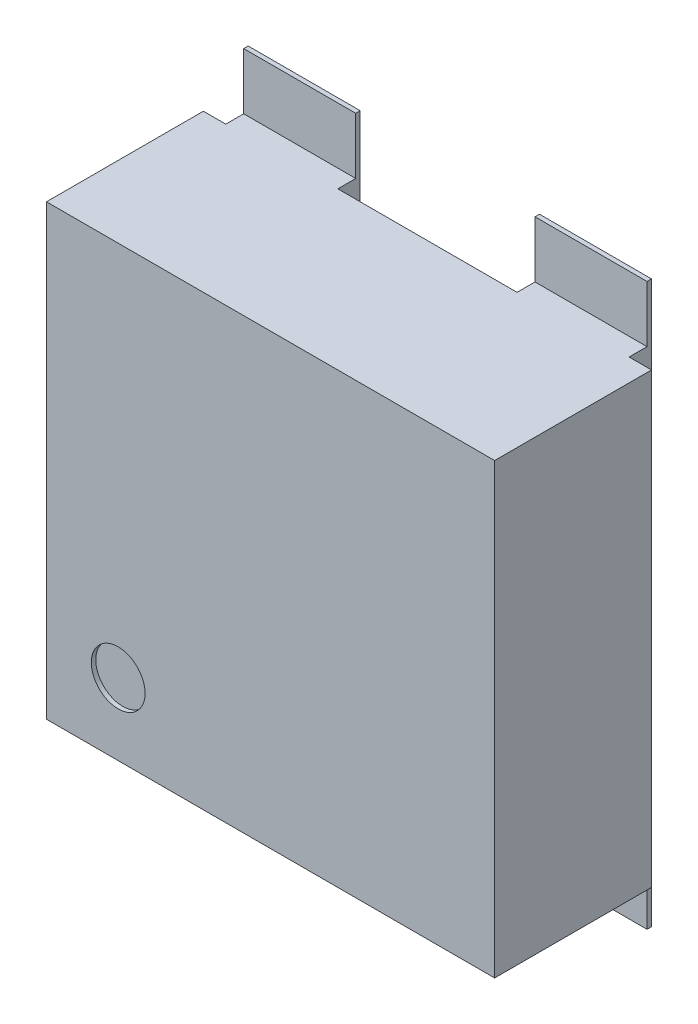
ISO-10303-21;
HEADER;
FILE_DESCRIPTION(('STEP AP214'),'2;1');
FILE_NAME('part.step','',(''),(''),'','','');
FILE_SCHEMA(('AUTOMOTIVE_DESIGN { 1 0 10303 214 1 1 1 1 }'));
ENDSEC;
DATA;
#1=APPLICATION_CONTEXT('core data for automotive mechanical design processes');
#2=APPLICATION_PROTOCOL_DEFINITION('international standard','automotive_design',2000,#1);
#3=PRODUCT_CONTEXT('',#1,'mechanical');
#4=PRODUCT('Part','Part','',(#3));
#5=PRODUCT_RELATED_PRODUCT_CATEGORY('part','',(#4));
#6=PRODUCT_DEFINITION_FORMATION('','',#4);
#7=PRODUCT_DEFINITION_CONTEXT('part definition',#1,'design');
#8=PRODUCT_DEFINITION('design','',#6,#7);
#9=PRODUCT_DEFINITION_SHAPE('','',#8);
#10=(LENGTH_UNIT() NAMED_UNIT(*) SI_UNIT(.MILLI.,.METRE.));
#11=(NAMED_UNIT(*) PLANE_ANGLE_UNIT() SI_UNIT($,.RADIAN.));
#12=(NAMED_UNIT(*) SI_UNIT($,.STERADIAN.) SOLID_ANGLE_UNIT());
#13=UNCERTAINTY_MEASURE_WITH_UNIT(LENGTH_MEASURE(1.E-05),#10,'distance_accuracy_value','');
#14=(GEOMETRIC_REPRESENTATION_CONTEXT(3) GLOBAL_UNCERTAINTY_ASSIGNED_CONTEXT((#13)) GLOBAL_UNIT_ASSIGNED_CONTEXT((#10,
#11,#12)) REPRESENTATION_CONTEXT('',''));
#15=CARTESIAN_POINT('',(0.,0.,0.));
#16=DIRECTION('',(0.,0.,1.));
#17=DIRECTION('',(1.,0.,0.));
#18=AXIS2_PLACEMENT_3D('',#15,#16,#17);
#19=CARTESIAN_POINT('',(-0.063000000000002,-0.276999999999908,0.0762));
#20=DIRECTION('',(0.,-1.,0.));
#21=DIRECTION('',(0.,0.,-1.));
#22=AXIS2_PLACEMENT_3D('',#19,#20,#21);
#23=PLANE('',#22);
#24=DIRECTION('',(0.,0.,1.));
#25=VECTOR('',#24,1.);
#26=CARTESIAN_POINT('',(-0.0630000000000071,-0.276999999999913,0.0762));
#27=LINE('',#26,#25);
#28=CARTESIAN_POINT('',(-0.0630000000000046,-0.276999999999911,0.0762));
#29=VERTEX_POINT('',#28);
#30=CARTESIAN_POINT('',(-0.0630000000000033,-0.276999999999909,0.0862000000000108));
#31=VERTEX_POINT('',#30);
#32=EDGE_CURVE('E292',#29,#31,#27,.T.);
#33=ORIENTED_EDGE('',*,*,#32,.F.);
#34=DIRECTION('',(1.,0.,0.));
#35=VECTOR('',#34,1.);
#36=CARTESIAN_POINT('',(0.,-0.276999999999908,0.0762));
#37=LINE('',#36,#35);
#38=CARTESIAN_POINT('',(0.063000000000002,-0.276999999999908,0.0762));
#39=VERTEX_POINT('',#38);
#40=EDGE_CURVE('E281',#29,#39,#37,.T.);
#41=ORIENTED_EDGE('',*,*,#40,.T.);
#42=DIRECTION('',(0.,0.,1.));
#43=VECTOR('',#42,1.);
#44=CARTESIAN_POINT('',(0.063000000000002,-0.276999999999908,0.0762));
#45=LINE('',#44,#43);
#46=CARTESIAN_POINT('',(0.063000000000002,-0.276999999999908,0.0862000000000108));
#47=VERTEX_POINT('',#46);
#48=EDGE_CURVE('E278',#47,#39,#45,.F.);
#49=ORIENTED_EDGE('',*,*,#48,.F.);
#50=DIRECTION('',(1.,0.,0.));
#51=VECTOR('',#50,1.);
#52=CARTESIAN_POINT('',(0.,-0.276999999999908,0.0862000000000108));
#53=LINE('',#52,#51);
#54=EDGE_CURVE('E275',#31,#47,#53,.T.);
#55=ORIENTED_EDGE('',*,*,#54,.F.);
#56=EDGE_LOOP('',(#33,#41,#49,#55));
#57=FACE_BOUND('',#56,.T.);
#58=ADVANCED_FACE('F16',(#57),#23,.T.);
#59=CARTESIAN_POINT('',(0.063000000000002,-0.276999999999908,0.0762));
#60=DIRECTION('',(0.708384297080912,-0.705826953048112,0.));
#61=DIRECTION('',(0.705826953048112,0.708384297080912,0.));
#62=AXIS2_PLACEMENT_3D('',#59,#60,#61);
#63=PLANE('',#62);
#64=DIRECTION('',(0.705826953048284,0.708384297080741,0.));
#65=VECTOR('',#64,1.);
#66=CARTESIAN_POINT('',(0.063000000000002,-0.276999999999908,0.0762));
#67=LINE('',#66,#65);
#68=CARTESIAN_POINT('',(0.22549362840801,-0.11391762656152,0.0762));
#69=VERTEX_POINT('',#68);
#70=EDGE_CURVE('E306',#39,#69,#67,.T.);
#71=ORIENTED_EDGE('',*,*,#70,.T.);
#72=DIRECTION('',(0.,0.,1.));
#73=VECTOR('',#72,1.);
#74=CARTESIAN_POINT('',(0.225493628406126,-0.113917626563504,0.0762));
#75=LINE('',#74,#73);
#76=CARTESIAN_POINT('',(0.225493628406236,-0.113917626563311,0.0862000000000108));
#77=VERTEX_POINT('',#76);
#78=EDGE_CURVE('E289',#69,#77,#75,.T.);
#79=ORIENTED_EDGE('',*,*,#78,.T.);
#80=DIRECTION('',(0.705826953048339,0.708384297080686,0.));
#81=VECTOR('',#80,1.);
#82=CARTESIAN_POINT('',(0.063000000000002,-0.276999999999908,0.0862000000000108));
#83=LINE('',#82,#81);
#84=EDGE_CURVE('E286',#47,#77,#83,.T.);
#85=ORIENTED_EDGE('',*,*,#84,.F.);
#86=ORIENTED_EDGE('',*,*,#48,.T.);
#87=EDGE_LOOP('',(#71,#79,#85,#86));
#88=FACE_BOUND('',#87,.T.);
#89=ADVANCED_FACE('F287',(#88),#63,.T.);
#90=CARTESIAN_POINT('',(0.,0.,0.0862000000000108));
#91=DIRECTION('',(0.,0.,1.));
#92=DIRECTION('',(1.,0.,0.));
#93=AXIS2_PLACEMENT_3D('',#90,#91,#92);
#94=PLANE('',#93);
#95=ORIENTED_EDGE('',*,*,#84,.T.);
#96=DIRECTION('',(-0.707106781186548,-0.707106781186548,0.));
#97=VECTOR('',#96,1.);
#98=CARTESIAN_POINT('',(0.33941125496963,0.,0.0862000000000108));
#99=LINE('',#98,#97);
#100=CARTESIAN_POINT('',(0.064999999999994,-0.274411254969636,0.0862000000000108));
#101=VERTEX_POINT('',#100);
#102=EDGE_CURVE('E350',#77,#101,#99,.T.);
#103=ORIENTED_EDGE('',*,*,#102,.T.);
#104=DIRECTION('',(1.,0.,0.));
#105=VECTOR('',#104,1.);
#106=CARTESIAN_POINT('',(0.064999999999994,-0.274411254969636,0.0862000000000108));
#107=LINE('',#106,#105);
#108=CARTESIAN_POINT('',(-0.064999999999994,-0.274411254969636,0.0862000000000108));
#109=VERTEX_POINT('',#108);
#110=EDGE_CURVE('E359',#101,#109,#107,.F.);
#111=ORIENTED_EDGE('',*,*,#110,.T.);
#112=DIRECTION('',(-0.707106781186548,0.707106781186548,0.));
#113=VECTOR('',#112,1.);
#114=CARTESIAN_POINT('',(-0.064999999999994,-0.274411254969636,0.0862000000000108));
#115=LINE('',#114,#113);
#116=CARTESIAN_POINT('',(-0.225493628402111,-0.113917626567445,0.0862000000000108));
#117=VERTEX_POINT('',#116);
#118=EDGE_CURVE('E364',#109,#117,#115,.T.);
#119=ORIENTED_EDGE('',*,*,#118,.T.);
#120=DIRECTION('',(0.705826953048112,-0.708384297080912,0.));
#121=VECTOR('',#120,1.);
#122=CARTESIAN_POINT('',(-0.338999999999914,0.,0.0862000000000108));
#123=LINE('',#122,#121);
#124=EDGE_CURVE('E296',#31,#117,#123,.F.);
#125=ORIENTED_EDGE('',*,*,#124,.F.);
#126=ORIENTED_EDGE('',*,*,#54,.T.);
#127=EDGE_LOOP('',(#95,#103,#111,#119,#125,#126));
#128=FACE_BOUND('',#127,.T.);
#129=ADVANCED_FACE('F294',(#128),#94,.T.);
#130=CARTESIAN_POINT('',(-0.338999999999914,0.,0.0762));
#131=DIRECTION('',(-0.708384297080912,-0.705826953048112,0.));
#132=DIRECTION('',(0.705826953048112,-0.708384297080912,0.));
#133=AXIS2_PLACEMENT_3D('',#130,#131,#132);
#134=PLANE('',#133);
#135=ORIENTED_EDGE('',*,*,#124,.T.);
#136=DIRECTION('',(0.,0.,1.));
#137=VECTOR('',#136,1.);
#138=CARTESIAN_POINT('',(-0.225493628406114,-0.113917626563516,0.0762));
#139=LINE('',#138,#137);
#140=CARTESIAN_POINT('',(-0.225493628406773,-0.113917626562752,0.0762));
#141=VERTEX_POINT('',#140);
#142=EDGE_CURVE('E366',#117,#141,#139,.F.);
#143=ORIENTED_EDGE('',*,*,#142,.T.);
#144=DIRECTION('',(0.705826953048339,-0.708384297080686,0.));
#145=VECTOR('',#144,1.);
#146=CARTESIAN_POINT('',(-0.225493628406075,-0.113917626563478,0.0762));
#147=LINE('',#146,#145);
#148=EDGE_CURVE('E302',#141,#29,#147,.T.);
#149=ORIENTED_EDGE('',*,*,#148,.T.);
#150=ORIENTED_EDGE('',*,*,#32,.T.);
#151=EDGE_LOOP('',(#135,#143,#149,#150));
#152=FACE_BOUND('',#151,.T.);
#153=ADVANCED_FACE('F782',(#152),#134,.T.);
#154=CARTESIAN_POINT('',(0.,0.,0.0762));
#155=DIRECTION('',(0.,0.,1.));
#156=DIRECTION('',(1.,0.,0.));
#157=AXIS2_PLACEMENT_3D('',#154,#155,#156);
#158=PLANE('',#157);
#159=DIRECTION('',(0.707106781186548,-0.707106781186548,0.));
#160=VECTOR('',#159,1.);
#161=CARTESIAN_POINT('',(0.,0.33941125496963,0.0762));
#162=LINE('',#161,#160);
#163=CARTESIAN_POINT('',(0.,0.33941125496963,0.0762));
#164=VERTEX_POINT('',#163);
#165=CARTESIAN_POINT('',(0.33941125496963,0.,0.0762));
#166=VERTEX_POINT('',#165);
#167=EDGE_CURVE('E348',#164,#166,#162,.T.);
#168=ORIENTED_EDGE('',*,*,#167,.T.);
#169=DIRECTION('',(-0.707106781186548,-0.707106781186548,0.));
#170=VECTOR('',#169,1.);
#171=CARTESIAN_POINT('',(0.33941125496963,0.,0.0762));
#172=LINE('',#171,#170);
#173=EDGE_CURVE('E355',#166,#69,#172,.T.);
#174=ORIENTED_EDGE('',*,*,#173,.T.);
#175=ORIENTED_EDGE('',*,*,#70,.F.);
#176=ORIENTED_EDGE('',*,*,#40,.F.);
#177=ORIENTED_EDGE('',*,*,#148,.F.);
#178=DIRECTION('',(-0.707106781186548,0.707106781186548,0.));
#179=VECTOR('',#178,1.);
#180=CARTESIAN_POINT('',(-0.064999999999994,-0.274411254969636,0.0762));
#181=LINE('',#180,#179);
#182=CARTESIAN_POINT('',(-0.33941125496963,0.,0.0762));
#183=VERTEX_POINT('',#182);
#184=EDGE_CURVE('E368',#141,#183,#181,.T.);
#185=ORIENTED_EDGE('',*,*,#184,.T.);
#186=DIRECTION('',(0.707106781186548,0.707106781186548,0.));
#187=VECTOR('',#186,1.);
#188=CARTESIAN_POINT('',(-0.33941125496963,0.,0.0762));
#189=LINE('',#188,#187);
#190=EDGE_CURVE('E373',#183,#164,#189,.T.);
#191=ORIENTED_EDGE('',*,*,#190,.T.);
#192=EDGE_LOOP('',(#168,#174,#175,#176,#177,#185,#191));
#193=FACE_BOUND('',#192,.T.);
#194=ADVANCED_FACE('F778',(#193),#158,.F.);
#195=CARTESIAN_POINT('',(0.,0.,0.0762));
#196=DIRECTION('',(0.,0.,1.));
#197=DIRECTION('',(1.,0.,0.));
#198=AXIS2_PLACEMENT_3D('',#195,#196,#197);
#199=PLANE('',#198);
#200=DIRECTION('',(1.,0.,0.));
#201=VECTOR('',#200,1.);
#202=CARTESIAN_POINT('',(0.380000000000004,-0.249999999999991,0.0762));
#203=LINE('',#202,#201);
#204=CARTESIAN_POINT('',(0.38000000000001,-0.249999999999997,0.0762));
#205=VERTEX_POINT('',#204);
#206=CARTESIAN_POINT('',(0.449999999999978,-0.249999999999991,0.0762));
#207=VERTEX_POINT('',#206);
#208=EDGE_CURVE('E329',#205,#207,#203,.T.);
#209=ORIENTED_EDGE('',*,*,#208,.T.);
#210=DIRECTION('',(0.,1.,0.));
#211=VECTOR('',#210,1.);
#212=CARTESIAN_POINT('',(0.449999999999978,-0.249999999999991,0.0762));
#213=LINE('',#212,#211);
#214=CARTESIAN_POINT('',(0.449999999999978,-0.626000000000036,0.0762));
#215=VERTEX_POINT('',#214);
#216=EDGE_CURVE('E400',#207,#215,#213,.F.);
#217=ORIENTED_EDGE('',*,*,#216,.T.);
#218=DIRECTION('',(1.,0.,0.));
#219=VECTOR('',#218,1.);
#220=CARTESIAN_POINT('',(0.199999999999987,-0.626000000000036,0.0762));
#221=LINE('',#220,#219);
#222=CARTESIAN_POINT('',(0.199999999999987,-0.626000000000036,0.0762));
#223=VERTEX_POINT('',#222);
#224=EDGE_CURVE('E308',#223,#215,#221,.T.);
#225=ORIENTED_EDGE('',*,*,#224,.F.);
#226=DIRECTION('',(0.,1.,0.));
#227=VECTOR('',#226,1.);
#228=CARTESIAN_POINT('',(0.199999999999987,-0.500000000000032,0.0762));
#229=LINE('',#228,#227);
#230=CARTESIAN_POINT('',(0.199999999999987,-0.430000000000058,0.0762));
#231=VERTEX_POINT('',#230);
#232=EDGE_CURVE('E390',#223,#231,#229,.T.);
#233=ORIENTED_EDGE('',*,*,#232,.T.);
#234=DIRECTION('',(0.707106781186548,0.707106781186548,0.));
#235=VECTOR('',#234,1.);
#236=CARTESIAN_POINT('',(0.199999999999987,-0.430000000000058,0.0762));
#237=LINE('',#236,#235);
#238=EDGE_CURVE('E327',#231,#205,#237,.T.);
#239=ORIENTED_EDGE('',*,*,#238,.T.);
#240=EDGE_LOOP('',(#209,#217,#225,#233,#239));
#241=FACE_BOUND('',#240,.T.);
#242=ADVANCED_FACE('F774',(#241),#199,.F.);
#243=CARTESIAN_POINT('',(0.199999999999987,-0.626000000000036,0.0762));
#244=DIRECTION('',(0.,-1.,0.));
#245=DIRECTION('',(0.,0.,-1.));
#246=AXIS2_PLACEMENT_3D('',#243,#244,#245);
#247=PLANE('',#246);
#248=DIRECTION('',(0.,0.,-1.));
#249=VECTOR('',#248,1.);
#250=CARTESIAN_POINT('',(0.199999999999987,-0.626000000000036,0.0762));
#251=LINE('',#250,#249);
#252=CARTESIAN_POINT('',(0.199999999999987,-0.626000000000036,0.0862000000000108));
#253=VERTEX_POINT('',#252);
#254=EDGE_CURVE('E387',#253,#223,#251,.T.);
#255=ORIENTED_EDGE('',*,*,#254,.T.);
#256=ORIENTED_EDGE('',*,*,#224,.T.);
#257=DIRECTION('',(0.,0.,1.));
#258=VECTOR('',#257,1.);
#259=CARTESIAN_POINT('',(0.449999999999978,-0.626000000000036,0.0762));
#260=LINE('',#259,#258);
#261=CARTESIAN_POINT('',(0.449999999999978,-0.626000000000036,0.0862000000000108));
#262=VERTEX_POINT('',#261);
#263=EDGE_CURVE('E402',#215,#262,#260,.T.);
#264=ORIENTED_EDGE('',*,*,#263,.T.);
#265=DIRECTION('',(1.,0.,0.));
#266=VECTOR('',#265,1.);
#267=CARTESIAN_POINT('',(0.,-0.626000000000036,0.0862000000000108));
#268=LINE('',#267,#266);
#269=EDGE_CURVE('E397',#253,#262,#268,.T.);
#270=ORIENTED_EDGE('',*,*,#269,.F.);
#271=EDGE_LOOP('',(#255,#256,#264,#270));
#272=FACE_BOUND('',#271,.T.);
#273=ADVANCED_FACE('F770',(#272),#247,.T.);
#274=CARTESIAN_POINT('',(0.,0.,0.0762));
#275=DIRECTION('',(0.,0.,1.));
#276=DIRECTION('',(1.,0.,0.));
#277=AXIS2_PLACEMENT_3D('',#274,#275,#276);
#278=PLANE('',#277);
#279=DIRECTION('',(0.707106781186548,-0.707106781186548,0.));
#280=VECTOR('',#279,1.);
#281=CARTESIAN_POINT('',(-0.380000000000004,-0.249999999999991,0.0762));
#282=LINE('',#281,#280);
#283=CARTESIAN_POINT('',(-0.380000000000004,-0.249999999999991,0.0762));
#284=VERTEX_POINT('',#283);
#285=CARTESIAN_POINT('',(-0.199999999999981,-0.430000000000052,0.0762));
#286=VERTEX_POINT('',#285);
#287=EDGE_CURVE('E322',#284,#286,#282,.T.);
#288=ORIENTED_EDGE('',*,*,#287,.T.);
#289=DIRECTION('',(0.,1.,0.));
#290=VECTOR('',#289,1.);
#291=CARTESIAN_POINT('',(-0.199999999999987,-0.430000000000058,0.0762));
#292=LINE('',#291,#290);
#293=CARTESIAN_POINT('',(-0.199999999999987,-0.626000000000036,0.0762));
#294=VERTEX_POINT('',#293);
#295=EDGE_CURVE('E380',#286,#294,#292,.F.);
#296=ORIENTED_EDGE('',*,*,#295,.T.);
#297=DIRECTION('',(1.,0.,0.));
#298=VECTOR('',#297,1.);
#299=CARTESIAN_POINT('',(-0.449999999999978,-0.626000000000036,0.0762));
#300=LINE('',#299,#298);
#301=CARTESIAN_POINT('',(-0.449999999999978,-0.626000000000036,0.0762));
#302=VERTEX_POINT('',#301);
#303=EDGE_CURVE('E311',#302,#294,#300,.T.);
#304=ORIENTED_EDGE('',*,*,#303,.F.);
#305=DIRECTION('',(0.,1.,0.));
#306=VECTOR('',#305,1.);
#307=CARTESIAN_POINT('',(-0.449999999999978,-0.500000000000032,0.0762));
#308=LINE('',#307,#306);
#309=CARTESIAN_POINT('',(-0.449999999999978,-0.249999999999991,0.0762));
#310=VERTEX_POINT('',#309);
#311=EDGE_CURVE('E412',#302,#310,#308,.T.);
#312=ORIENTED_EDGE('',*,*,#311,.T.);
#313=DIRECTION('',(1.,0.,0.));
#314=VECTOR('',#313,1.);
#315=CARTESIAN_POINT('',(-0.449999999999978,-0.249999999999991,0.0762));
#316=LINE('',#315,#314);
#317=EDGE_CURVE('E320',#310,#284,#316,.T.);
#318=ORIENTED_EDGE('',*,*,#317,.T.);
#319=EDGE_LOOP('',(#288,#296,#304,#312,#318));
#320=FACE_BOUND('',#319,.T.);
#321=ADVANCED_FACE('F766',(#320),#278,.F.);
#322=CARTESIAN_POINT('',(-0.449999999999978,-0.626000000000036,0.0762));
#323=DIRECTION('',(0.,-1.,0.));
#324=DIRECTION('',(0.,0.,-1.));
#325=AXIS2_PLACEMENT_3D('',#322,#323,#324);
#326=PLANE('',#325);
#327=DIRECTION('',(0.,0.,-1.));
#328=VECTOR('',#327,1.);
#329=CARTESIAN_POINT('',(-0.449999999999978,-0.626000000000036,0.0762));
#330=LINE('',#329,#328);
#331=CARTESIAN_POINT('',(-0.449999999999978,-0.626000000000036,0.0862000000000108));
#332=VERTEX_POINT('',#331);
#333=EDGE_CURVE('E409',#332,#302,#330,.T.);
#334=ORIENTED_EDGE('',*,*,#333,.T.);
#335=ORIENTED_EDGE('',*,*,#303,.T.);
#336=DIRECTION('',(0.,0.,1.));
#337=VECTOR('',#336,1.);
#338=CARTESIAN_POINT('',(-0.199999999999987,-0.626000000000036,0.0762));
#339=LINE('',#338,#337);
#340=CARTESIAN_POINT('',(-0.199999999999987,-0.626000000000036,0.0862000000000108));
#341=VERTEX_POINT('',#340);
#342=EDGE_CURVE('E382',#294,#341,#339,.T.);
#343=ORIENTED_EDGE('',*,*,#342,.T.);
#344=DIRECTION('',(1.,0.,0.));
#345=VECTOR('',#344,1.);
#346=CARTESIAN_POINT('',(0.,-0.626000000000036,0.0862000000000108));
#347=LINE('',#346,#345);
#348=EDGE_CURVE('E419',#332,#341,#347,.T.);
#349=ORIENTED_EDGE('',*,*,#348,.F.);
#350=EDGE_LOOP('',(#334,#335,#343,#349));
#351=FACE_BOUND('',#350,.T.);
#352=ADVANCED_FACE('F762',(#351),#326,.T.);
#353=CARTESIAN_POINT('',(0.,0.,0.0762));
#354=DIRECTION('',(0.,0.,1.));
#355=DIRECTION('',(1.,0.,0.));
#356=AXIS2_PLACEMENT_3D('',#353,#354,#355);
#357=PLANE('',#356);
#358=DIRECTION('',(-0.707106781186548,0.707106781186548,0.));
#359=VECTOR('',#358,1.);
#360=CARTESIAN_POINT('',(0.380000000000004,0.249999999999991,0.0762));
#361=LINE('',#360,#359);
#362=CARTESIAN_POINT('',(0.380000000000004,0.249999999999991,0.0762));
#363=VERTEX_POINT('',#362);
#364=CARTESIAN_POINT('',(0.199999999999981,0.430000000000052,0.0762));
#365=VERTEX_POINT('',#364);
#366=EDGE_CURVE('E336',#363,#365,#361,.T.);
#367=ORIENTED_EDGE('',*,*,#366,.T.);
#368=DIRECTION('',(0.,1.,0.));
#369=VECTOR('',#368,1.);
#370=CARTESIAN_POINT('',(0.199999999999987,0.430000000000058,0.0762));
#371=LINE('',#370,#369);
#372=CARTESIAN_POINT('',(0.199999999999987,0.626000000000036,0.0762));
#373=VERTEX_POINT('',#372);
#374=EDGE_CURVE('E445',#365,#373,#371,.T.);
#375=ORIENTED_EDGE('',*,*,#374,.T.);
#376=DIRECTION('',(1.,0.,0.));
#377=VECTOR('',#376,1.);
#378=CARTESIAN_POINT('',(0.449999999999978,0.626000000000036,0.0762));
#379=LINE('',#378,#377);
#380=CARTESIAN_POINT('',(0.449999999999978,0.626000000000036,0.0762));
#381=VERTEX_POINT('',#380);
#382=EDGE_CURVE('E314',#381,#373,#379,.F.);
#383=ORIENTED_EDGE('',*,*,#382,.F.);
#384=DIRECTION('',(0.,1.,0.));
#385=VECTOR('',#384,1.);
#386=CARTESIAN_POINT('',(0.449999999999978,0.500000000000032,0.0762));
#387=LINE('',#386,#385);
#388=CARTESIAN_POINT('',(0.449999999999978,0.249999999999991,0.0762));
#389=VERTEX_POINT('',#388);
#390=EDGE_CURVE('E435',#381,#389,#387,.F.);
#391=ORIENTED_EDGE('',*,*,#390,.T.);
#392=DIRECTION('',(1.,0.,0.));
#393=VECTOR('',#392,1.);
#394=CARTESIAN_POINT('',(0.449999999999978,0.249999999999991,0.0762));
#395=LINE('',#394,#393);
#396=EDGE_CURVE('E334',#389,#363,#395,.F.);
#397=ORIENTED_EDGE('',*,*,#396,.T.);
#398=EDGE_LOOP('',(#367,#375,#383,#391,#397));
#399=FACE_BOUND('',#398,.T.);
#400=ADVANCED_FACE('F758',(#399),#357,.F.);
#401=CARTESIAN_POINT('',(0.449999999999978,0.626000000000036,0.0762));
#402=DIRECTION('',(0.,1.,0.));
#403=DIRECTION('',(0.,0.,1.));
#404=AXIS2_PLACEMENT_3D('',#401,#402,#403);
#405=PLANE('',#404);
#406=DIRECTION('',(0.,0.,1.));
#407=VECTOR('',#406,1.);
#408=CARTESIAN_POINT('',(0.449999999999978,0.626000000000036,0.0762));
#409=LINE('',#408,#407);
#410=CARTESIAN_POINT('',(0.449999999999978,0.626000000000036,0.0862000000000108));
#411=VERTEX_POINT('',#410);
#412=EDGE_CURVE('E432',#411,#381,#409,.F.);
#413=ORIENTED_EDGE('',*,*,#412,.T.);
#414=ORIENTED_EDGE('',*,*,#382,.T.);
#415=DIRECTION('',(0.,0.,-1.));
#416=VECTOR('',#415,1.);
#417=CARTESIAN_POINT('',(0.199999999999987,0.626000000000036,0.0762));
#418=LINE('',#417,#416);
#419=CARTESIAN_POINT('',(0.199999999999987,0.626000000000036,0.0862000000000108));
#420=VERTEX_POINT('',#419);
#421=EDGE_CURVE('E447',#373,#420,#418,.F.);
#422=ORIENTED_EDGE('',*,*,#421,.T.);
#423=DIRECTION('',(1.,0.,0.));
#424=VECTOR('',#423,1.);
#425=CARTESIAN_POINT('',(0.,0.626000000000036,0.0862000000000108));
#426=LINE('',#425,#424);
#427=EDGE_CURVE('E442',#411,#420,#426,.F.);
#428=ORIENTED_EDGE('',*,*,#427,.F.);
#429=EDGE_LOOP('',(#413,#414,#422,#428));
#430=FACE_BOUND('',#429,.T.);
#431=ADVANCED_FACE('F754',(#430),#405,.T.);
#432=CARTESIAN_POINT('',(0.,0.,0.0762));
#433=DIRECTION('',(0.,0.,1.));
#434=DIRECTION('',(1.,0.,0.));
#435=AXIS2_PLACEMENT_3D('',#432,#433,#434);
#436=PLANE('',#435);
#437=DIRECTION('',(1.,0.,0.));
#438=VECTOR('',#437,1.);
#439=CARTESIAN_POINT('',(-0.380000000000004,0.249999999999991,0.0762));
#440=LINE('',#439,#438);
#441=CARTESIAN_POINT('',(-0.38000000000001,0.249999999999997,0.0762));
#442=VERTEX_POINT('',#441);
#443=CARTESIAN_POINT('',(-0.449999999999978,0.249999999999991,0.0762));
#444=VERTEX_POINT('',#443);
#445=EDGE_CURVE('E343',#442,#444,#440,.F.);
#446=ORIENTED_EDGE('',*,*,#445,.T.);
#447=DIRECTION('',(0.,1.,0.));
#448=VECTOR('',#447,1.);
#449=CARTESIAN_POINT('',(-0.449999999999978,0.249999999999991,0.0762));
#450=LINE('',#449,#448);
#451=CARTESIAN_POINT('',(-0.449999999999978,0.626000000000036,0.0762));
#452=VERTEX_POINT('',#451);
#453=EDGE_CURVE('E425',#444,#452,#450,.T.);
#454=ORIENTED_EDGE('',*,*,#453,.T.);
#455=DIRECTION('',(1.,0.,0.));
#456=VECTOR('',#455,1.);
#457=CARTESIAN_POINT('',(-0.199999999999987,0.626000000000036,0.0762));
#458=LINE('',#457,#456);
#459=CARTESIAN_POINT('',(-0.199999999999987,0.626000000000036,0.0762));
#460=VERTEX_POINT('',#459);
#461=EDGE_CURVE('E317',#460,#452,#458,.F.);
#462=ORIENTED_EDGE('',*,*,#461,.F.);
#463=DIRECTION('',(0.,1.,0.));
#464=VECTOR('',#463,1.);
#465=CARTESIAN_POINT('',(-0.199999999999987,0.500000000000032,0.0762));
#466=LINE('',#465,#464);
#467=CARTESIAN_POINT('',(-0.199999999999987,0.430000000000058,0.0762));
#468=VERTEX_POINT('',#467);
#469=EDGE_CURVE('E457',#460,#468,#466,.F.);
#470=ORIENTED_EDGE('',*,*,#469,.T.);
#471=DIRECTION('',(-0.707106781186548,-0.707106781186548,0.));
#472=VECTOR('',#471,1.);
#473=CARTESIAN_POINT('',(-0.199999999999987,0.430000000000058,0.0762));
#474=LINE('',#473,#472);
#475=EDGE_CURVE('E341',#468,#442,#474,.T.);
#476=ORIENTED_EDGE('',*,*,#475,.T.);
#477=EDGE_LOOP('',(#446,#454,#462,#470,#476));
#478=FACE_BOUND('',#477,.T.);
#479=ADVANCED_FACE('F750',(#478),#436,.F.);
#480=CARTESIAN_POINT('',(-0.199999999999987,0.626000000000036,0.0762));
#481=DIRECTION('',(0.,1.,0.));
#482=DIRECTION('',(0.,0.,1.));
#483=AXIS2_PLACEMENT_3D('',#480,#481,#482);
#484=PLANE('',#483);
#485=DIRECTION('',(0.,0.,1.));
#486=VECTOR('',#485,1.);
#487=CARTESIAN_POINT('',(-0.199999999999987,0.626000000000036,0.0762));
#488=LINE('',#487,#486);
#489=CARTESIAN_POINT('',(-0.199999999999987,0.626000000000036,0.0862000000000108));
#490=VERTEX_POINT('',#489);
#491=EDGE_CURVE('E454',#490,#460,#488,.F.);
#492=ORIENTED_EDGE('',*,*,#491,.T.);
#493=ORIENTED_EDGE('',*,*,#461,.T.);
#494=DIRECTION('',(0.,0.,-1.));
#495=VECTOR('',#494,1.);
#496=CARTESIAN_POINT('',(-0.449999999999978,0.626000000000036,0.0762));
#497=LINE('',#496,#495);
#498=CARTESIAN_POINT('',(-0.449999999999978,0.626000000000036,0.0862000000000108));
#499=VERTEX_POINT('',#498);
#500=EDGE_CURVE('E427',#452,#499,#497,.F.);
#501=ORIENTED_EDGE('',*,*,#500,.T.);
#502=DIRECTION('',(1.,0.,0.));
#503=VECTOR('',#502,1.);
#504=CARTESIAN_POINT('',(0.,0.626000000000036,0.0862000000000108));
#505=LINE('',#504,#503);
#506=EDGE_CURVE('E464',#490,#499,#505,.F.);
#507=ORIENTED_EDGE('',*,*,#506,.F.);
#508=EDGE_LOOP('',(#492,#493,#501,#507));
#509=FACE_BOUND('',#508,.T.);
#510=ADVANCED_FACE('F746',(#509),#484,.T.);
#511=CARTESIAN_POINT('',(-0.449999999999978,-0.249999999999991,0.0762));
#512=DIRECTION('',(0.,-1.,0.));
#513=DIRECTION('',(0.,0.,-1.));
#514=AXIS2_PLACEMENT_3D('',#511,#512,#513);
#515=PLANE('',#514);
#516=DIRECTION('',(1.,0.,0.));
#517=VECTOR('',#516,1.);
#518=CARTESIAN_POINT('',(0.,-0.249999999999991,0.126200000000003));
#519=LINE('',#518,#517);
#520=CARTESIAN_POINT('',(-0.449999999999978,-0.249999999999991,0.126200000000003));
#521=VERTEX_POINT('',#520);
#522=CARTESIAN_POINT('',(-0.380000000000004,-0.249999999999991,0.126200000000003));
#523=VERTEX_POINT('',#522);
#524=EDGE_CURVE('E473',#521,#523,#519,.T.);
#525=ORIENTED_EDGE('',*,*,#524,.T.);
#526=DIRECTION('',(0.,0.,1.));
#527=VECTOR('',#526,1.);
#528=CARTESIAN_POINT('',(-0.380000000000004,-0.249999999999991,0.0762));
#529=LINE('',#528,#527);
#530=EDGE_CURVE('E324',#523,#284,#529,.F.);
#531=ORIENTED_EDGE('',*,*,#530,.T.);
#532=ORIENTED_EDGE('',*,*,#317,.F.);
#533=DIRECTION('',(0.,0.,-1.));
#534=VECTOR('',#533,1.);
#535=CARTESIAN_POINT('',(-0.449999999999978,-0.249999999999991,0.0762));
#536=LINE('',#535,#534);
#537=EDGE_CURVE('E414',#310,#521,#536,.F.);
#538=ORIENTED_EDGE('',*,*,#537,.T.);
#539=EDGE_LOOP('',(#525,#531,#532,#538));
#540=FACE_BOUND('',#539,.T.);
#541=ADVANCED_FACE('F742',(#540),#515,.F.);
#542=CARTESIAN_POINT('',(-0.380000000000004,-0.249999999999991,0.0762));
#543=DIRECTION('',(-0.707106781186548,-0.707106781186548,0.));
#544=DIRECTION('',(0.707106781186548,-0.707106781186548,0.));
#545=AXIS2_PLACEMENT_3D('',#542,#543,#544);
#546=PLANE('',#545);
#547=DIRECTION('',(0.707106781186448,-0.707106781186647,0.));
#548=VECTOR('',#547,1.);
#549=CARTESIAN_POINT('',(-0.380000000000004,-0.249999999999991,0.126200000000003));
#550=LINE('',#549,#548);
#551=CARTESIAN_POINT('',(-0.199999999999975,-0.430000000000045,0.126200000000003));
#552=VERTEX_POINT('',#551);
#553=EDGE_CURVE('E475',#523,#552,#550,.T.);
#554=ORIENTED_EDGE('',*,*,#553,.T.);
#555=DIRECTION('',(0.,0.,1.));
#556=VECTOR('',#555,1.);
#557=CARTESIAN_POINT('',(-0.199999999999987,-0.430000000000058,0.0762));
#558=LINE('',#557,#556);
#559=EDGE_CURVE('E384',#552,#286,#558,.F.);
#560=ORIENTED_EDGE('',*,*,#559,.T.);
#561=ORIENTED_EDGE('',*,*,#287,.F.);
#562=ORIENTED_EDGE('',*,*,#530,.F.);
#563=EDGE_LOOP('',(#554,#560,#561,#562));
#564=FACE_BOUND('',#563,.T.);
#565=ADVANCED_FACE('F738',(#564),#546,.F.);
#566=CARTESIAN_POINT('',(0.199999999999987,-0.430000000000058,0.0762));
#567=DIRECTION('',(0.707106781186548,-0.707106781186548,0.));
#568=DIRECTION('',(0.707106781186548,0.707106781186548,0.));
#569=AXIS2_PLACEMENT_3D('',#566,#567,#568);
#570=PLANE('',#569);
#571=DIRECTION('',(0.707106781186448,0.707106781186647,0.));
#572=VECTOR('',#571,1.);
#573=CARTESIAN_POINT('',(0.199999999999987,-0.430000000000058,0.126200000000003));
#574=LINE('',#573,#572);
#575=CARTESIAN_POINT('',(0.199999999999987,-0.430000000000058,0.126200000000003));
#576=VERTEX_POINT('',#575);
#577=CARTESIAN_POINT('',(0.380000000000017,-0.250000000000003,0.126200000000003));
#578=VERTEX_POINT('',#577);
#579=EDGE_CURVE('E482',#576,#578,#574,.T.);
#580=ORIENTED_EDGE('',*,*,#579,.T.);
#581=DIRECTION('',(0.,0.,-1.));
#582=VECTOR('',#581,1.);
#583=CARTESIAN_POINT('',(0.380000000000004,-0.249999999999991,0.0762));
#584=LINE('',#583,#582);
#585=EDGE_CURVE('E331',#578,#205,#584,.T.);
#586=ORIENTED_EDGE('',*,*,#585,.T.);
#587=ORIENTED_EDGE('',*,*,#238,.F.);
#588=DIRECTION('',(0.,0.,-1.));
#589=VECTOR('',#588,1.);
#590=CARTESIAN_POINT('',(0.199999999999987,-0.430000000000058,0.0762));
#591=LINE('',#590,#589);
#592=EDGE_CURVE('E392',#231,#576,#591,.F.);
#593=ORIENTED_EDGE('',*,*,#592,.T.);
#594=EDGE_LOOP('',(#580,#586,#587,#593));
#595=FACE_BOUND('',#594,.T.);
#596=ADVANCED_FACE('F734',(#595),#570,.F.);
#597=CARTESIAN_POINT('',(0.380000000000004,-0.249999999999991,0.0762));
#598=DIRECTION('',(0.,-1.,0.));
#599=DIRECTION('',(0.,0.,-1.));
#600=AXIS2_PLACEMENT_3D('',#597,#598,#599);
#601=PLANE('',#600);
#602=DIRECTION('',(1.,0.,0.));
#603=VECTOR('',#602,1.);
#604=CARTESIAN_POINT('',(0.,-0.249999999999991,0.126200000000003));
#605=LINE('',#604,#603);
#606=CARTESIAN_POINT('',(0.449999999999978,-0.249999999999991,0.126200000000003));
#607=VERTEX_POINT('',#606);
#608=EDGE_CURVE('E484',#578,#607,#605,.T.);
#609=ORIENTED_EDGE('',*,*,#608,.T.);
#610=DIRECTION('',(0.,0.,1.));
#611=VECTOR('',#610,1.);
#612=CARTESIAN_POINT('',(0.449999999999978,-0.249999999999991,0.0762));
#613=LINE('',#612,#611);
#614=EDGE_CURVE('E406',#607,#207,#613,.F.);
#615=ORIENTED_EDGE('',*,*,#614,.T.);
#616=ORIENTED_EDGE('',*,*,#208,.F.);
#617=ORIENTED_EDGE('',*,*,#585,.F.);
#618=EDGE_LOOP('',(#609,#615,#616,#617));
#619=FACE_BOUND('',#618,.T.);
#620=ADVANCED_FACE('F730',(#619),#601,.F.);
#621=CARTESIAN_POINT('',(0.449999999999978,0.249999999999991,0.0762));
#622=DIRECTION('',(0.,1.,0.));
#623=DIRECTION('',(0.,0.,1.));
#624=AXIS2_PLACEMENT_3D('',#621,#622,#623);
#625=PLANE('',#624);
#626=DIRECTION('',(1.,0.,0.));
#627=VECTOR('',#626,1.);
#628=CARTESIAN_POINT('',(0.,0.249999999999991,0.126200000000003));
#629=LINE('',#628,#627);
#630=CARTESIAN_POINT('',(0.449999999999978,0.249999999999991,0.126200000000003));
#631=VERTEX_POINT('',#630);
#632=CARTESIAN_POINT('',(0.380000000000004,0.249999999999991,0.126200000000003));
#633=VERTEX_POINT('',#632);
#634=EDGE_CURVE('E491',#631,#633,#629,.F.);
#635=ORIENTED_EDGE('',*,*,#634,.T.);
#636=DIRECTION('',(0.,0.,1.));
#637=VECTOR('',#636,1.);
#638=CARTESIAN_POINT('',(0.380000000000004,0.249999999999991,0.0762));
#639=LINE('',#638,#637);
#640=EDGE_CURVE('E338',#633,#363,#639,.F.);
#641=ORIENTED_EDGE('',*,*,#640,.T.);
#642=ORIENTED_EDGE('',*,*,#396,.F.);
#643=DIRECTION('',(0.,0.,1.));
#644=VECTOR('',#643,1.);
#645=CARTESIAN_POINT('',(0.449999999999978,0.249999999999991,0.0762));
#646=LINE('',#645,#644);
#647=EDGE_CURVE('E437',#389,#631,#646,.T.);
#648=ORIENTED_EDGE('',*,*,#647,.T.);
#649=EDGE_LOOP('',(#635,#641,#642,#648));
#650=FACE_BOUND('',#649,.T.);
#651=ADVANCED_FACE('F726',(#650),#625,.F.);
#652=CARTESIAN_POINT('',(0.380000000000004,0.249999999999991,0.0762));
#653=DIRECTION('',(0.707106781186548,0.707106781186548,0.));
#654=DIRECTION('',(-0.707106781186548,0.707106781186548,0.));
#655=AXIS2_PLACEMENT_3D('',#652,#653,#654);
#656=PLANE('',#655);
#657=DIRECTION('',(-0.707106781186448,0.707106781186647,0.));
#658=VECTOR('',#657,1.);
#659=CARTESIAN_POINT('',(0.380000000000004,0.249999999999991,0.126200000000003));
#660=LINE('',#659,#658);
#661=CARTESIAN_POINT('',(0.199999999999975,0.430000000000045,0.126200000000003));
#662=VERTEX_POINT('',#661);
#663=EDGE_CURVE('E493',#633,#662,#660,.T.);
#664=ORIENTED_EDGE('',*,*,#663,.T.);
#665=DIRECTION('',(0.,0.,-1.));
#666=VECTOR('',#665,1.);
#667=CARTESIAN_POINT('',(0.199999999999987,0.430000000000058,0.0762));
#668=LINE('',#667,#666);
#669=EDGE_CURVE('E451',#662,#365,#668,.T.);
#670=ORIENTED_EDGE('',*,*,#669,.T.);
#671=ORIENTED_EDGE('',*,*,#366,.F.);
#672=ORIENTED_EDGE('',*,*,#640,.F.);
#673=EDGE_LOOP('',(#664,#670,#671,#672));
#674=FACE_BOUND('',#673,.T.);
#675=ADVANCED_FACE('F722',(#674),#656,.F.);
#676=CARTESIAN_POINT('',(-0.199999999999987,0.430000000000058,0.0762));
#677=DIRECTION('',(-0.707106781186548,0.707106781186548,0.));
#678=DIRECTION('',(-0.707106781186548,-0.707106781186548,0.));
#679=AXIS2_PLACEMENT_3D('',#676,#677,#678);
#680=PLANE('',#679);
#681=DIRECTION('',(-0.707106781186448,-0.707106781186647,0.));
#682=VECTOR('',#681,1.);
#683=CARTESIAN_POINT('',(-0.199999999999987,0.430000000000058,0.126200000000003));
#684=LINE('',#683,#682);
#685=CARTESIAN_POINT('',(-0.199999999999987,0.430000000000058,0.126200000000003));
#686=VERTEX_POINT('',#685);
#687=CARTESIAN_POINT('',(-0.380000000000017,0.250000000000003,0.126200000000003));
#688=VERTEX_POINT('',#687);
#689=EDGE_CURVE('E500',#686,#688,#684,.T.);
#690=ORIENTED_EDGE('',*,*,#689,.T.);
#691=DIRECTION('',(0.,0.,1.));
#692=VECTOR('',#691,1.);
#693=CARTESIAN_POINT('',(-0.380000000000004,0.249999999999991,0.0762));
#694=LINE('',#693,#692);
#695=EDGE_CURVE('E345',#688,#442,#694,.F.);
#696=ORIENTED_EDGE('',*,*,#695,.T.);
#697=ORIENTED_EDGE('',*,*,#475,.F.);
#698=DIRECTION('',(0.,0.,1.));
#699=VECTOR('',#698,1.);
#700=CARTESIAN_POINT('',(-0.199999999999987,0.430000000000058,0.0762));
#701=LINE('',#700,#699);
#702=EDGE_CURVE('E459',#468,#686,#701,.T.);
#703=ORIENTED_EDGE('',*,*,#702,.T.);
#704=EDGE_LOOP('',(#690,#696,#697,#703));
#705=FACE_BOUND('',#704,.T.);
#706=ADVANCED_FACE('F718',(#705),#680,.F.);
#707=CARTESIAN_POINT('',(-0.380000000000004,0.249999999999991,0.0762));
#708=DIRECTION('',(0.,1.,0.));
#709=DIRECTION('',(0.,0.,1.));
#710=AXIS2_PLACEMENT_3D('',#707,#708,#709);
#711=PLANE('',#710);
#712=DIRECTION('',(1.,0.,0.));
#713=VECTOR('',#712,1.);
#714=CARTESIAN_POINT('',(0.,0.249999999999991,0.126200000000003));
#715=LINE('',#714,#713);
#716=CARTESIAN_POINT('',(-0.449999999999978,0.249999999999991,0.126200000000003));
#717=VERTEX_POINT('',#716);
#718=EDGE_CURVE('E502',#688,#717,#715,.F.);
#719=ORIENTED_EDGE('',*,*,#718,.T.);
#720=DIRECTION('',(0.,0.,-1.));
#721=VECTOR('',#720,1.);
#722=CARTESIAN_POINT('',(-0.449999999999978,0.249999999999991,0.0762));
#723=LINE('',#722,#721);
#724=EDGE_CURVE('E429',#717,#444,#723,.T.);
#725=ORIENTED_EDGE('',*,*,#724,.T.);
#726=ORIENTED_EDGE('',*,*,#445,.F.);
#727=ORIENTED_EDGE('',*,*,#695,.F.);
#728=EDGE_LOOP('',(#719,#725,#726,#727));
#729=FACE_BOUND('',#728,.T.);
#730=ADVANCED_FACE('F714',(#729),#711,.F.);
#731=CARTESIAN_POINT('',(0.,0.33941125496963,0.0762));
#732=DIRECTION('',(-0.707106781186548,-0.707106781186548,0.));
#733=DIRECTION('',(0.707106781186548,-0.707106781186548,0.));
#734=AXIS2_PLACEMENT_3D('',#731,#732,#733);
#735=PLANE('',#734);
#736=DIRECTION('',(0.707106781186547,-0.707106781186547,0.));
#737=VECTOR('',#736,1.);
#738=CARTESIAN_POINT('',(0.,0.33941125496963,0.126200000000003));
#739=LINE('',#738,#737);
#740=CARTESIAN_POINT('',(0.,0.33941125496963,0.126200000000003));
#741=VERTEX_POINT('',#740);
#742=CARTESIAN_POINT('',(0.33941125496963,0.,0.126200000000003));
#743=VERTEX_POINT('',#742);
#744=EDGE_CURVE('E506',#741,#743,#739,.T.);
#745=ORIENTED_EDGE('',*,*,#744,.T.);
#746=DIRECTION('',(0.,0.,1.));
#747=VECTOR('',#746,1.);
#748=CARTESIAN_POINT('',(0.33941125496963,0.,0.0762));
#749=LINE('',#748,#747);
#750=EDGE_CURVE('E352',#743,#166,#749,.F.);
#751=ORIENTED_EDGE('',*,*,#750,.T.);
#752=ORIENTED_EDGE('',*,*,#167,.F.);
#753=DIRECTION('',(0.,0.,1.));
#754=VECTOR('',#753,1.);
#755=CARTESIAN_POINT('',(0.,0.33941125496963,0.0762));
#756=LINE('',#755,#754);
#757=EDGE_CURVE('E375',#164,#741,#756,.T.);
#758=ORIENTED_EDGE('',*,*,#757,.T.);
#759=EDGE_LOOP('',(#745,#751,#752,#758));
#760=FACE_BOUND('',#759,.T.);
#761=ADVANCED_FACE('F710',(#760),#735,.F.);
#762=CARTESIAN_POINT('',(0.33941125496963,0.,0.0762));
#763=DIRECTION('',(-0.707106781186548,0.707106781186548,0.));
#764=DIRECTION('',(-0.707106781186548,-0.707106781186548,0.));
#765=AXIS2_PLACEMENT_3D('',#762,#763,#764);
#766=PLANE('',#765);
#767=ORIENTED_EDGE('',*,*,#173,.F.);
#768=ORIENTED_EDGE('',*,*,#750,.F.);
#769=DIRECTION('',(-0.707106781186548,-0.707106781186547,0.));
#770=VECTOR('',#769,1.);
#771=CARTESIAN_POINT('',(0.33941125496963,0.,0.126200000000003));
#772=LINE('',#771,#770);
#773=CARTESIAN_POINT('',(0.064999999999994,-0.274411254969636,0.126200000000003));
#774=VERTEX_POINT('',#773);
#775=EDGE_CURVE('E508',#743,#774,#772,.T.);
#776=ORIENTED_EDGE('',*,*,#775,.T.);
#777=DIRECTION('',(0.,0.,1.));
#778=VECTOR('',#777,1.);
#779=CARTESIAN_POINT('',(0.064999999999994,-0.274411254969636,0.0762));
#780=LINE('',#779,#778);
#781=EDGE_CURVE('E361',#774,#101,#780,.F.);
#782=ORIENTED_EDGE('',*,*,#781,.T.);
#783=ORIENTED_EDGE('',*,*,#102,.F.);
#784=ORIENTED_EDGE('',*,*,#78,.F.);
#785=EDGE_LOOP('',(#767,#768,#776,#782,#783,#784));
#786=FACE_BOUND('',#785,.T.);
#787=ADVANCED_FACE('F706',(#786),#766,.F.);
#788=CARTESIAN_POINT('',(0.064999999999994,-0.274411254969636,0.0762));
#789=DIRECTION('',(0.,1.,0.));
#790=DIRECTION('',(0.,0.,1.));
#791=AXIS2_PLACEMENT_3D('',#788,#789,#790);
#792=PLANE('',#791);
#793=DIRECTION('',(1.,0.,0.));
#794=VECTOR('',#793,1.);
#795=CARTESIAN_POINT('',(0.,-0.274411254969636,0.126200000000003));
#796=LINE('',#795,#794);
#797=CARTESIAN_POINT('',(-0.064999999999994,-0.274411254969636,0.126200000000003));
#798=VERTEX_POINT('',#797);
#799=EDGE_CURVE('E510',#774,#798,#796,.F.);
#800=ORIENTED_EDGE('',*,*,#799,.T.);
#801=DIRECTION('',(0.,0.,1.));
#802=VECTOR('',#801,1.);
#803=CARTESIAN_POINT('',(-0.064999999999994,-0.274411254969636,0.0762));
#804=LINE('',#803,#802);
#805=EDGE_CURVE('E370',#798,#109,#804,.F.);
#806=ORIENTED_EDGE('',*,*,#805,.T.);
#807=ORIENTED_EDGE('',*,*,#110,.F.);
#808=ORIENTED_EDGE('',*,*,#781,.F.);
#809=EDGE_LOOP('',(#800,#806,#807,#808));
#810=FACE_BOUND('',#809,.T.);
#811=ADVANCED_FACE('F702',(#810),#792,.F.);
#812=CARTESIAN_POINT('',(-0.064999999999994,-0.274411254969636,0.0762));
#813=DIRECTION('',(0.707106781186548,0.707106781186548,0.));
#814=DIRECTION('',(-0.707106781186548,0.707106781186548,0.));
#815=AXIS2_PLACEMENT_3D('',#812,#813,#814);
#816=PLANE('',#815);
#817=DIRECTION('',(-0.707106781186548,0.707106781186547,0.));
#818=VECTOR('',#817,1.);
#819=CARTESIAN_POINT('',(-0.064999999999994,-0.274411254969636,0.126200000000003));
#820=LINE('',#819,#818);
#821=CARTESIAN_POINT('',(-0.33941125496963,0.,0.126200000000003));
#822=VERTEX_POINT('',#821);
#823=EDGE_CURVE('E512',#798,#822,#820,.T.);
#824=ORIENTED_EDGE('',*,*,#823,.T.);
#825=DIRECTION('',(0.,0.,1.));
#826=VECTOR('',#825,1.);
#827=CARTESIAN_POINT('',(-0.33941125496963,0.,0.0762));
#828=LINE('',#827,#826);
#829=EDGE_CURVE('E377',#822,#183,#828,.F.);
#830=ORIENTED_EDGE('',*,*,#829,.T.);
#831=ORIENTED_EDGE('',*,*,#184,.F.);
#832=ORIENTED_EDGE('',*,*,#142,.F.);
#833=ORIENTED_EDGE('',*,*,#118,.F.);
#834=ORIENTED_EDGE('',*,*,#805,.F.);
#835=EDGE_LOOP('',(#824,#830,#831,#832,#833,#834));
#836=FACE_BOUND('',#835,.T.);
#837=ADVANCED_FACE('F698',(#836),#816,.F.);
#838=CARTESIAN_POINT('',(-0.33941125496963,0.,0.0762));
#839=DIRECTION('',(0.707106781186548,-0.707106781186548,0.));
#840=DIRECTION('',(0.707106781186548,0.707106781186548,0.));
#841=AXIS2_PLACEMENT_3D('',#838,#839,#840);
#842=PLANE('',#841);
#843=DIRECTION('',(0.707106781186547,0.707106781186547,0.));
#844=VECTOR('',#843,1.);
#845=CARTESIAN_POINT('',(-0.33941125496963,0.,0.126200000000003));
#846=LINE('',#845,#844);
#847=EDGE_CURVE('E514',#822,#741,#846,.T.);
#848=ORIENTED_EDGE('',*,*,#847,.T.);
#849=ORIENTED_EDGE('',*,*,#757,.F.);
#850=ORIENTED_EDGE('',*,*,#190,.F.);
#851=ORIENTED_EDGE('',*,*,#829,.F.);
#852=EDGE_LOOP('',(#848,#849,#850,#851));
#853=FACE_BOUND('',#852,.T.);
#854=ADVANCED_FACE('F694',(#853),#842,.F.);
#855=CARTESIAN_POINT('',(-0.199999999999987,-0.430000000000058,0.0762));
#856=DIRECTION('',(-1.,0.,0.));
#857=DIRECTION('',(0.,0.,1.));
#858=AXIS2_PLACEMENT_3D('',#855,#856,#857);
#859=PLANE('',#858);
#860=DIRECTION('',(0.,1.,0.));
#861=VECTOR('',#860,1.);
#862=CARTESIAN_POINT('',(-0.199999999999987,0.,0.126200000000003));
#863=LINE('',#862,#861);
#864=CARTESIAN_POINT('',(-0.199999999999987,-0.500000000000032,0.126200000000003));
#865=VERTEX_POINT('',#864);
#866=EDGE_CURVE('E477',#552,#865,#863,.F.);
#867=ORIENTED_EDGE('',*,*,#866,.T.);
#868=DIRECTION('',(0.,0.,-1.));
#869=VECTOR('',#868,1.);
#870=CARTESIAN_POINT('',(-0.199999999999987,-0.500000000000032,0.0762));
#871=LINE('',#870,#869);
#872=CARTESIAN_POINT('',(-0.199999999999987,-0.500000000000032,0.0862000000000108));
#873=VERTEX_POINT('',#872);
#874=EDGE_CURVE('E517',#873,#865,#871,.F.);
#875=ORIENTED_EDGE('',*,*,#874,.F.);
#876=DIRECTION('',(0.,1.,0.));
#877=VECTOR('',#876,1.);
#878=CARTESIAN_POINT('',(-0.199999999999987,0.,0.0862000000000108));
#879=LINE('',#878,#877);
#880=EDGE_CURVE('E422',#341,#873,#879,.T.);
#881=ORIENTED_EDGE('',*,*,#880,.F.);
#882=ORIENTED_EDGE('',*,*,#342,.F.);
#883=ORIENTED_EDGE('',*,*,#295,.F.);
#884=ORIENTED_EDGE('',*,*,#559,.F.);
#885=EDGE_LOOP('',(#867,#875,#881,#882,#883,#884));
#886=FACE_BOUND('',#885,.T.);
#887=ADVANCED_FACE('F690',(#886),#859,.F.);
#888=CARTESIAN_POINT('',(0.199999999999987,-0.500000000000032,0.0762));
#889=DIRECTION('',(1.,0.,0.));
#890=DIRECTION('',(0.,0.,-1.));
#891=AXIS2_PLACEMENT_3D('',#888,#889,#890);
#892=PLANE('',#891);
#893=ORIENTED_EDGE('',*,*,#592,.F.);
#894=ORIENTED_EDGE('',*,*,#232,.F.);
#895=ORIENTED_EDGE('',*,*,#254,.F.);
#896=DIRECTION('',(0.,1.,0.));
#897=VECTOR('',#896,1.);
#898=CARTESIAN_POINT('',(0.199999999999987,0.,0.0862000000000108));
#899=LINE('',#898,#897);
#900=CARTESIAN_POINT('',(0.199999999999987,-0.500000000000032,0.0862000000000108));
#901=VERTEX_POINT('',#900);
#902=EDGE_CURVE('E394',#901,#253,#899,.F.);
#903=ORIENTED_EDGE('',*,*,#902,.F.);
#904=DIRECTION('',(0.,0.,-1.));
#905=VECTOR('',#904,1.);
#906=CARTESIAN_POINT('',(0.199999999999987,-0.500000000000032,0.0762));
#907=LINE('',#906,#905);
#908=CARTESIAN_POINT('',(0.199999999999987,-0.500000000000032,0.126200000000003));
#909=VERTEX_POINT('',#908);
#910=EDGE_CURVE('E523',#909,#901,#907,.T.);
#911=ORIENTED_EDGE('',*,*,#910,.F.);
#912=DIRECTION('',(0.,1.,0.));
#913=VECTOR('',#912,1.);
#914=CARTESIAN_POINT('',(0.199999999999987,0.,0.126200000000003));
#915=LINE('',#914,#913);
#916=EDGE_CURVE('E479',#909,#576,#915,.T.);
#917=ORIENTED_EDGE('',*,*,#916,.T.);
#918=EDGE_LOOP('',(#893,#894,#895,#903,#911,#917));
#919=FACE_BOUND('',#918,.T.);
#920=ADVANCED_FACE('F686',(#919),#892,.F.);
#921=CARTESIAN_POINT('',(0.,0.,0.0862000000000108));
#922=DIRECTION('',(0.,0.,1.));
#923=DIRECTION('',(1.,0.,0.));
#924=AXIS2_PLACEMENT_3D('',#921,#922,#923);
#925=PLANE('',#924);
#926=DIRECTION('',(0.,1.,0.));
#927=VECTOR('',#926,1.);
#928=CARTESIAN_POINT('',(0.449999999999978,-0.249999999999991,0.0862000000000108));
#929=LINE('',#928,#927);
#930=CARTESIAN_POINT('',(0.449999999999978,-0.500000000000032,0.0862000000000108));
#931=VERTEX_POINT('',#930);
#932=EDGE_CURVE('E404',#262,#931,#929,.T.);
#933=ORIENTED_EDGE('',*,*,#932,.T.);
#934=DIRECTION('',(1.,0.,0.));
#935=VECTOR('',#934,1.);
#936=CARTESIAN_POINT('',(-0.500000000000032,-0.500000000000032,0.0862000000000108));
#937=LINE('',#936,#935);
#938=EDGE_CURVE('E526',#901,#931,#937,.T.);
#939=ORIENTED_EDGE('',*,*,#938,.F.);
#940=ORIENTED_EDGE('',*,*,#902,.T.);
#941=ORIENTED_EDGE('',*,*,#269,.T.);
#942=EDGE_LOOP('',(#933,#939,#940,#941));
#943=FACE_BOUND('',#942,.T.);
#944=ADVANCED_FACE('F682',(#943),#925,.T.);
#945=CARTESIAN_POINT('',(0.449999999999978,-0.249999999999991,0.0762));
#946=DIRECTION('',(-1.,0.,0.));
#947=DIRECTION('',(0.,0.,1.));
#948=AXIS2_PLACEMENT_3D('',#945,#946,#947);
#949=PLANE('',#948);
#950=DIRECTION('',(0.,1.,0.));
#951=VECTOR('',#950,1.);
#952=CARTESIAN_POINT('',(0.449999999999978,0.,0.126200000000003));
#953=LINE('',#952,#951);
#954=CARTESIAN_POINT('',(0.449999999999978,-0.500000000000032,0.126200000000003));
#955=VERTEX_POINT('',#954);
#956=EDGE_CURVE('E486',#607,#955,#953,.F.);
#957=ORIENTED_EDGE('',*,*,#956,.T.);
#958=DIRECTION('',(0.,0.,-1.));
#959=VECTOR('',#958,1.);
#960=CARTESIAN_POINT('',(0.449999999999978,-0.500000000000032,0.0762));
#961=LINE('',#960,#959);
#962=EDGE_CURVE('E529',#931,#955,#961,.F.);
#963=ORIENTED_EDGE('',*,*,#962,.F.);
#964=ORIENTED_EDGE('',*,*,#932,.F.);
#965=ORIENTED_EDGE('',*,*,#263,.F.);
#966=ORIENTED_EDGE('',*,*,#216,.F.);
#967=ORIENTED_EDGE('',*,*,#614,.F.);
#968=EDGE_LOOP('',(#957,#963,#964,#965,#966,#967));
#969=FACE_BOUND('',#968,.T.);
#970=ADVANCED_FACE('F678',(#969),#949,.F.);
#971=CARTESIAN_POINT('',(-0.449999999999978,-0.500000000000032,0.0762));
#972=DIRECTION('',(1.,0.,0.));
#973=DIRECTION('',(0.,0.,-1.));
#974=AXIS2_PLACEMENT_3D('',#971,#972,#973);
#975=PLANE('',#974);
#976=ORIENTED_EDGE('',*,*,#537,.F.);
#977=ORIENTED_EDGE('',*,*,#311,.F.);
#978=ORIENTED_EDGE('',*,*,#333,.F.);
#979=DIRECTION('',(0.,1.,0.));
#980=VECTOR('',#979,1.);
#981=CARTESIAN_POINT('',(-0.449999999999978,0.,0.0862000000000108));
#982=LINE('',#981,#980);
#983=CARTESIAN_POINT('',(-0.449999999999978,-0.500000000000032,0.0862000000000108));
#984=VERTEX_POINT('',#983);
#985=EDGE_CURVE('E416',#984,#332,#982,.F.);
#986=ORIENTED_EDGE('',*,*,#985,.F.);
#987=DIRECTION('',(0.,0.,-1.));
#988=VECTOR('',#987,1.);
#989=CARTESIAN_POINT('',(-0.449999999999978,-0.500000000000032,0.0762));
#990=LINE('',#989,#988);
#991=CARTESIAN_POINT('',(-0.449999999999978,-0.500000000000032,0.126200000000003));
#992=VERTEX_POINT('',#991);
#993=EDGE_CURVE('E537',#992,#984,#990,.T.);
#994=ORIENTED_EDGE('',*,*,#993,.F.);
#995=DIRECTION('',(0.,1.,0.));
#996=VECTOR('',#995,1.);
#997=CARTESIAN_POINT('',(-0.449999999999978,0.,0.126200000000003));
#998=LINE('',#997,#996);
#999=EDGE_CURVE('E470',#992,#521,#998,.T.);
#1000=ORIENTED_EDGE('',*,*,#999,.T.);
#1001=EDGE_LOOP('',(#976,#977,#978,#986,#994,#1000));
#1002=FACE_BOUND('',#1001,.T.);
#1003=ADVANCED_FACE('F674',(#1002),#975,.F.);
#1004=CARTESIAN_POINT('',(0.,0.,0.0862000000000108));
#1005=DIRECTION('',(0.,0.,1.));
#1006=DIRECTION('',(1.,0.,0.));
#1007=AXIS2_PLACEMENT_3D('',#1004,#1005,#1006);
#1008=PLANE('',#1007);
#1009=ORIENTED_EDGE('',*,*,#880,.T.);
#1010=DIRECTION('',(1.,0.,0.));
#1011=VECTOR('',#1010,1.);
#1012=CARTESIAN_POINT('',(-0.500000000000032,-0.500000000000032,0.0862000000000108));
#1013=LINE('',#1012,#1011);
#1014=EDGE_CURVE('E540',#984,#873,#1013,.T.);
#1015=ORIENTED_EDGE('',*,*,#1014,.F.);
#1016=ORIENTED_EDGE('',*,*,#985,.T.);
#1017=ORIENTED_EDGE('',*,*,#348,.T.);
#1018=EDGE_LOOP('',(#1009,#1015,#1016,#1017));
#1019=FACE_BOUND('',#1018,.T.);
#1020=ADVANCED_FACE('F670',(#1019),#1008,.T.);
#1021=CARTESIAN_POINT('',(-0.449999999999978,0.249999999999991,0.0762));
#1022=DIRECTION('',(1.,0.,0.));
#1023=DIRECTION('',(0.,0.,-1.));
#1024=AXIS2_PLACEMENT_3D('',#1021,#1022,#1023);
#1025=PLANE('',#1024);
#1026=DIRECTION('',(0.,1.,0.));
#1027=VECTOR('',#1026,1.);
#1028=CARTESIAN_POINT('',(-0.449999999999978,0.,0.126200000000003));
#1029=LINE('',#1028,#1027);
#1030=CARTESIAN_POINT('',(-0.449999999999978,0.500000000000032,0.126200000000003));
#1031=VERTEX_POINT('',#1030);
#1032=EDGE_CURVE('E504',#717,#1031,#1029,.T.);
#1033=ORIENTED_EDGE('',*,*,#1032,.T.);
#1034=DIRECTION('',(0.,0.,1.));
#1035=VECTOR('',#1034,1.);
#1036=CARTESIAN_POINT('',(-0.449999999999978,0.500000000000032,0.0762));
#1037=LINE('',#1036,#1035);
#1038=CARTESIAN_POINT('',(-0.449999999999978,0.500000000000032,0.0862000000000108));
#1039=VERTEX_POINT('',#1038);
#1040=EDGE_CURVE('E548',#1039,#1031,#1037,.T.);
#1041=ORIENTED_EDGE('',*,*,#1040,.F.);
#1042=DIRECTION('',(0.,1.,0.));
#1043=VECTOR('',#1042,1.);
#1044=CARTESIAN_POINT('',(-0.449999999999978,0.,0.0862000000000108));
#1045=LINE('',#1044,#1043);
#1046=EDGE_CURVE('E467',#499,#1039,#1045,.F.);
#1047=ORIENTED_EDGE('',*,*,#1046,.F.);
#1048=ORIENTED_EDGE('',*,*,#500,.F.);
#1049=ORIENTED_EDGE('',*,*,#453,.F.);
#1050=ORIENTED_EDGE('',*,*,#724,.F.);
#1051=EDGE_LOOP('',(#1033,#1041,#1047,#1048,#1049,#1050));
#1052=FACE_BOUND('',#1051,.T.);
#1053=ADVANCED_FACE('F666',(#1052),#1025,.F.);
#1054=CARTESIAN_POINT('',(0.449999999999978,0.500000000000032,0.0762));
#1055=DIRECTION('',(-1.,0.,0.));
#1056=DIRECTION('',(0.,0.,1.));
#1057=AXIS2_PLACEMENT_3D('',#1054,#1055,#1056);
#1058=PLANE('',#1057);
#1059=ORIENTED_EDGE('',*,*,#647,.F.);
#1060=ORIENTED_EDGE('',*,*,#390,.F.);
#1061=ORIENTED_EDGE('',*,*,#412,.F.);
#1062=DIRECTION('',(0.,1.,0.));
#1063=VECTOR('',#1062,1.);
#1064=CARTESIAN_POINT('',(0.449999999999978,0.,0.0862000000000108));
#1065=LINE('',#1064,#1063);
#1066=CARTESIAN_POINT('',(0.449999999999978,0.500000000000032,0.0862000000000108));
#1067=VERTEX_POINT('',#1066);
#1068=EDGE_CURVE('E439',#1067,#411,#1065,.T.);
#1069=ORIENTED_EDGE('',*,*,#1068,.F.);
#1070=DIRECTION('',(0.,0.,1.));
#1071=VECTOR('',#1070,1.);
#1072=CARTESIAN_POINT('',(0.449999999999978,0.500000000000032,0.0762));
#1073=LINE('',#1072,#1071);
#1074=CARTESIAN_POINT('',(0.449999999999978,0.500000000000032,0.126200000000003));
#1075=VERTEX_POINT('',#1074);
#1076=EDGE_CURVE('E559',#1075,#1067,#1073,.F.);
#1077=ORIENTED_EDGE('',*,*,#1076,.F.);
#1078=DIRECTION('',(0.,1.,0.));
#1079=VECTOR('',#1078,1.);
#1080=CARTESIAN_POINT('',(0.449999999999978,0.,0.126200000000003));
#1081=LINE('',#1080,#1079);
#1082=EDGE_CURVE('E488',#1075,#631,#1081,.F.);
#1083=ORIENTED_EDGE('',*,*,#1082,.T.);
#1084=EDGE_LOOP('',(#1059,#1060,#1061,#1069,#1077,#1083));
#1085=FACE_BOUND('',#1084,.T.);
#1086=ADVANCED_FACE('F662',(#1085),#1058,.F.);
#1087=CARTESIAN_POINT('',(0.,0.,0.0862000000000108));
#1088=DIRECTION('',(0.,0.,1.));
#1089=DIRECTION('',(1.,0.,0.));
#1090=AXIS2_PLACEMENT_3D('',#1087,#1088,#1089);
#1091=PLANE('',#1090);
#1092=DIRECTION('',(0.,1.,0.));
#1093=VECTOR('',#1092,1.);
#1094=CARTESIAN_POINT('',(0.199999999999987,0.430000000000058,0.0862000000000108));
#1095=LINE('',#1094,#1093);
#1096=CARTESIAN_POINT('',(0.199999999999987,0.500000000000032,0.0862000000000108));
#1097=VERTEX_POINT('',#1096);
#1098=EDGE_CURVE('E449',#420,#1097,#1095,.F.);
#1099=ORIENTED_EDGE('',*,*,#1098,.T.);
#1100=DIRECTION('',(1.,0.,0.));
#1101=VECTOR('',#1100,1.);
#1102=CARTESIAN_POINT('',(0.500000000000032,0.500000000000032,0.0862000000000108));
#1103=LINE('',#1102,#1101);
#1104=EDGE_CURVE('E562',#1067,#1097,#1103,.F.);
#1105=ORIENTED_EDGE('',*,*,#1104,.F.);
#1106=ORIENTED_EDGE('',*,*,#1068,.T.);
#1107=ORIENTED_EDGE('',*,*,#427,.T.);
#1108=EDGE_LOOP('',(#1099,#1105,#1106,#1107));
#1109=FACE_BOUND('',#1108,.T.);
#1110=ADVANCED_FACE('F658',(#1109),#1091,.T.);
#1111=CARTESIAN_POINT('',(0.199999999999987,0.430000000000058,0.0762));
#1112=DIRECTION('',(1.,0.,0.));
#1113=DIRECTION('',(0.,0.,-1.));
#1114=AXIS2_PLACEMENT_3D('',#1111,#1112,#1113);
#1115=PLANE('',#1114);
#1116=DIRECTION('',(0.,1.,0.));
#1117=VECTOR('',#1116,1.);
#1118=CARTESIAN_POINT('',(0.199999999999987,0.,0.126200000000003));
#1119=LINE('',#1118,#1117);
#1120=CARTESIAN_POINT('',(0.199999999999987,0.500000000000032,0.126200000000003));
#1121=VERTEX_POINT('',#1120);
#1122=EDGE_CURVE('E495',#662,#1121,#1119,.T.);
#1123=ORIENTED_EDGE('',*,*,#1122,.T.);
#1124=DIRECTION('',(0.,0.,1.));
#1125=VECTOR('',#1124,1.);
#1126=CARTESIAN_POINT('',(0.199999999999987,0.500000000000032,0.0762));
#1127=LINE('',#1126,#1125);
#1128=EDGE_CURVE('E565',#1097,#1121,#1127,.T.);
#1129=ORIENTED_EDGE('',*,*,#1128,.F.);
#1130=ORIENTED_EDGE('',*,*,#1098,.F.);
#1131=ORIENTED_EDGE('',*,*,#421,.F.);
#1132=ORIENTED_EDGE('',*,*,#374,.F.);
#1133=ORIENTED_EDGE('',*,*,#669,.F.);
#1134=EDGE_LOOP('',(#1123,#1129,#1130,#1131,#1132,#1133));
#1135=FACE_BOUND('',#1134,.T.);
#1136=ADVANCED_FACE('F654',(#1135),#1115,.F.);
#1137=CARTESIAN_POINT('',(-0.199999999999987,0.500000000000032,0.0762));
#1138=DIRECTION('',(-1.,0.,0.));
#1139=DIRECTION('',(0.,0.,1.));
#1140=AXIS2_PLACEMENT_3D('',#1137,#1138,#1139);
#1141=PLANE('',#1140);
#1142=ORIENTED_EDGE('',*,*,#702,.F.);
#1143=ORIENTED_EDGE('',*,*,#469,.F.);
#1144=ORIENTED_EDGE('',*,*,#491,.F.);
#1145=DIRECTION('',(0.,1.,0.));
#1146=VECTOR('',#1145,1.);
#1147=CARTESIAN_POINT('',(-0.199999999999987,0.,0.0862000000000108));
#1148=LINE('',#1147,#1146);
#1149=CARTESIAN_POINT('',(-0.199999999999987,0.500000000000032,0.0862000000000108));
#1150=VERTEX_POINT('',#1149);
#1151=EDGE_CURVE('E461',#1150,#490,#1148,.T.);
#1152=ORIENTED_EDGE('',*,*,#1151,.F.);
#1153=DIRECTION('',(0.,0.,1.));
#1154=VECTOR('',#1153,1.);
#1155=CARTESIAN_POINT('',(-0.199999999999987,0.500000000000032,0.0762));
#1156=LINE('',#1155,#1154);
#1157=CARTESIAN_POINT('',(-0.199999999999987,0.500000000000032,0.126200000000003));
#1158=VERTEX_POINT('',#1157);
#1159=EDGE_CURVE('E571',#1158,#1150,#1156,.F.);
#1160=ORIENTED_EDGE('',*,*,#1159,.F.);
#1161=DIRECTION('',(0.,1.,0.));
#1162=VECTOR('',#1161,1.);
#1163=CARTESIAN_POINT('',(-0.199999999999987,0.,0.126200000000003));
#1164=LINE('',#1163,#1162);
#1165=EDGE_CURVE('E497',#1158,#686,#1164,.F.);
#1166=ORIENTED_EDGE('',*,*,#1165,.T.);
#1167=EDGE_LOOP('',(#1142,#1143,#1144,#1152,#1160,#1166));
#1168=FACE_BOUND('',#1167,.T.);
#1169=ADVANCED_FACE('F650',(#1168),#1141,.F.);
#1170=CARTESIAN_POINT('',(0.,0.,0.0862000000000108));
#1171=DIRECTION('',(0.,0.,1.));
#1172=DIRECTION('',(1.,0.,0.));
#1173=AXIS2_PLACEMENT_3D('',#1170,#1171,#1172);
#1174=PLANE('',#1173);
#1175=ORIENTED_EDGE('',*,*,#1046,.T.);
#1176=DIRECTION('',(1.,0.,0.));
#1177=VECTOR('',#1176,1.);
#1178=CARTESIAN_POINT('',(0.500000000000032,0.500000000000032,0.0862000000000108));
#1179=LINE('',#1178,#1177);
#1180=EDGE_CURVE('E574',#1150,#1039,#1179,.F.);
#1181=ORIENTED_EDGE('',*,*,#1180,.F.);
#1182=ORIENTED_EDGE('',*,*,#1151,.T.);
#1183=ORIENTED_EDGE('',*,*,#506,.T.);
#1184=EDGE_LOOP('',(#1175,#1181,#1182,#1183));
#1185=FACE_BOUND('',#1184,.T.);
#1186=ADVANCED_FACE('F644',(#1185),#1174,.T.);
#1187=CARTESIAN_POINT('',(0.,0.,0.126200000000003));
#1188=DIRECTION('',(0.,0.,1.));
#1189=DIRECTION('',(1.,0.,0.));
#1190=AXIS2_PLACEMENT_3D('',#1187,#1188,#1189);
#1191=PLANE('',#1190);
#1192=ORIENTED_EDGE('',*,*,#823,.F.);
#1193=ORIENTED_EDGE('',*,*,#799,.F.);
#1194=ORIENTED_EDGE('',*,*,#775,.F.);
#1195=ORIENTED_EDGE('',*,*,#744,.F.);
#1196=ORIENTED_EDGE('',*,*,#847,.F.);
#1197=EDGE_LOOP('',(#1192,#1193,#1194,#1195,#1196));
#1198=FACE_BOUND('',#1197,.T.);
#1199=DIRECTION('',(0.,1.,0.));
#1200=VECTOR('',#1199,1.);
#1201=CARTESIAN_POINT('',(-0.500000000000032,0.500000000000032,0.126200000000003));
#1202=LINE('',#1201,#1200);
#1203=CARTESIAN_POINT('',(-0.500000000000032,0.500000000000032,0.126200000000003));
#1204=VERTEX_POINT('',#1203);
#1205=CARTESIAN_POINT('',(-0.500000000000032,-0.500000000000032,0.126200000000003));
#1206=VERTEX_POINT('',#1205);
#1207=EDGE_CURVE('E581',#1204,#1206,#1202,.F.);
#1208=ORIENTED_EDGE('',*,*,#1207,.F.);
#1209=DIRECTION('',(1.,0.,0.));
#1210=VECTOR('',#1209,1.);
#1211=CARTESIAN_POINT('',(0.500000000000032,0.500000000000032,0.126200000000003));
#1212=LINE('',#1211,#1210);
#1213=EDGE_CURVE('E551',#1031,#1204,#1212,.F.);
#1214=ORIENTED_EDGE('',*,*,#1213,.F.);
#1215=ORIENTED_EDGE('',*,*,#1032,.F.);
#1216=ORIENTED_EDGE('',*,*,#718,.F.);
#1217=ORIENTED_EDGE('',*,*,#689,.F.);
#1218=ORIENTED_EDGE('',*,*,#1165,.F.);
#1219=DIRECTION('',(1.,0.,0.));
#1220=VECTOR('',#1219,1.);
#1221=CARTESIAN_POINT('',(0.500000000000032,0.500000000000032,0.126200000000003));
#1222=LINE('',#1221,#1220);
#1223=EDGE_CURVE('E568',#1121,#1158,#1222,.F.);
#1224=ORIENTED_EDGE('',*,*,#1223,.F.);
#1225=ORIENTED_EDGE('',*,*,#1122,.F.);
#1226=ORIENTED_EDGE('',*,*,#663,.F.);
#1227=ORIENTED_EDGE('',*,*,#634,.F.);
#1228=ORIENTED_EDGE('',*,*,#1082,.F.);
#1229=DIRECTION('',(1.,0.,0.));
#1230=VECTOR('',#1229,1.);
#1231=CARTESIAN_POINT('',(0.500000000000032,0.500000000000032,0.126200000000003));
#1232=LINE('',#1231,#1230);
#1233=CARTESIAN_POINT('',(0.500000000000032,0.500000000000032,0.126200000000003));
#1234=VERTEX_POINT('',#1233);
#1235=EDGE_CURVE('E556',#1234,#1075,#1232,.F.);
#1236=ORIENTED_EDGE('',*,*,#1235,.F.);
#1237=DIRECTION('',(0.,1.,0.));
#1238=VECTOR('',#1237,1.);
#1239=CARTESIAN_POINT('',(0.500000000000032,-0.500000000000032,0.126200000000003));
#1240=LINE('',#1239,#1238);
#1241=CARTESIAN_POINT('',(0.500000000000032,-0.500000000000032,0.126200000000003));
#1242=VERTEX_POINT('',#1241);
#1243=EDGE_CURVE('E546',#1242,#1234,#1240,.T.);
#1244=ORIENTED_EDGE('',*,*,#1243,.F.);
#1245=DIRECTION('',(1.,0.,0.));
#1246=VECTOR('',#1245,1.);
#1247=CARTESIAN_POINT('',(-0.500000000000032,-0.500000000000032,0.126200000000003));
#1248=LINE('',#1247,#1246);
#1249=EDGE_CURVE('E532',#955,#1242,#1248,.T.);
#1250=ORIENTED_EDGE('',*,*,#1249,.F.);
#1251=ORIENTED_EDGE('',*,*,#956,.F.);
#1252=ORIENTED_EDGE('',*,*,#608,.F.);
#1253=ORIENTED_EDGE('',*,*,#579,.F.);
#1254=ORIENTED_EDGE('',*,*,#916,.F.);
#1255=DIRECTION('',(1.,0.,0.));
#1256=VECTOR('',#1255,1.);
#1257=CARTESIAN_POINT('',(-0.500000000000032,-0.500000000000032,0.126200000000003));
#1258=LINE('',#1257,#1256);
#1259=EDGE_CURVE('E520',#865,#909,#1258,.T.);
#1260=ORIENTED_EDGE('',*,*,#1259,.F.);
#1261=ORIENTED_EDGE('',*,*,#866,.F.);
#1262=ORIENTED_EDGE('',*,*,#553,.F.);
#1263=ORIENTED_EDGE('',*,*,#524,.F.);
#1264=ORIENTED_EDGE('',*,*,#999,.F.);
#1265=DIRECTION('',(1.,0.,0.));
#1266=VECTOR('',#1265,1.);
#1267=CARTESIAN_POINT('',(-0.500000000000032,-0.500000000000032,0.126200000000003));
#1268=LINE('',#1267,#1266);
#1269=EDGE_CURVE('E534',#1206,#992,#1268,.T.);
#1270=ORIENTED_EDGE('',*,*,#1269,.F.);
#1271=EDGE_LOOP('',(#1208,#1214,#1215,#1216,#1217,#1218,#1224,#1225,#1226,#1227,#1228,#1236,
#1244,#1250,#1251,#1252,#1253,#1254,#1260,#1261,#1262,#1263,#1264,#1270));
#1272=FACE_BOUND('',#1271,.T.);
#1273=ADVANCED_FACE('F637',(#1198,#1272),#1191,.F.);
#1274=CARTESIAN_POINT('',(0.,0.,0.46625000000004));
#1275=DIRECTION('',(0.,0.,1.));
#1276=DIRECTION('',(1.,0.,0.));
#1277=AXIS2_PLACEMENT_3D('',#1274,#1275,#1276);
#1278=PLANE('',#1277);
#1279=CARTESIAN_POINT('',(-0.33999999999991,-0.33999999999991,0.46625000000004));
#1280=DIRECTION('',(0.,0.,1.));
#1281=DIRECTION('',(1.,0.,0.));
#1282=AXIS2_PLACEMENT_3D('',#1279,#1280,#1281);
#1283=CIRCLE('',#1282,0.0599999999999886);
#1284=CARTESIAN_POINT('',(-0.279999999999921,-0.33999999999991,0.46625000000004));
#1285=VERTEX_POINT('',#1284);
#1286=EDGE_CURVE('E19',#1285,#1285,#1283,.T.);
#1287=ORIENTED_EDGE('',*,*,#1286,.T.);
#1288=EDGE_LOOP('',(#1287));
#1289=FACE_BOUND('',#1288,.T.);
#1290=ADVANCED_FACE('F635',(#1289),#1278,.T.);
#1291=CARTESIAN_POINT('',(-0.500000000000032,-0.500000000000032,0.0762));
#1292=DIRECTION('',(0.,-1.,0.));
#1293=DIRECTION('',(0.,0.,-1.));
#1294=AXIS2_PLACEMENT_3D('',#1291,#1292,#1293);
#1295=PLANE('',#1294);
#1296=ORIENTED_EDGE('',*,*,#993,.T.);
#1297=ORIENTED_EDGE('',*,*,#1014,.T.);
#1298=ORIENTED_EDGE('',*,*,#874,.T.);
#1299=ORIENTED_EDGE('',*,*,#1259,.T.);
#1300=ORIENTED_EDGE('',*,*,#910,.T.);
#1301=ORIENTED_EDGE('',*,*,#938,.T.);
#1302=ORIENTED_EDGE('',*,*,#962,.T.);
#1303=ORIENTED_EDGE('',*,*,#1249,.T.);
#1304=DIRECTION('',(0.,0.,-1.));
#1305=VECTOR('',#1304,1.);
#1306=CARTESIAN_POINT('',(0.500000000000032,-0.500000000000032,0.0762));
#1307=LINE('',#1306,#1305);
#1308=CARTESIAN_POINT('',(0.500000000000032,-0.500000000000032,0.47625));
#1309=VERTEX_POINT('',#1308);
#1310=EDGE_CURVE('E543',#1309,#1242,#1307,.T.);
#1311=ORIENTED_EDGE('',*,*,#1310,.F.);
#1312=DIRECTION('',(1.,0.,0.));
#1313=VECTOR('',#1312,1.);
#1314=CARTESIAN_POINT('',(0.,-0.500000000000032,0.47625));
#1315=LINE('',#1314,#1313);
#1316=CARTESIAN_POINT('',(-0.500000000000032,-0.500000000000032,0.47625));
#1317=VERTEX_POINT('',#1316);
#1318=EDGE_CURVE('E584',#1317,#1309,#1315,.T.);
#1319=ORIENTED_EDGE('',*,*,#1318,.F.);
#1320=DIRECTION('',(0.,0.,1.));
#1321=VECTOR('',#1320,1.);
#1322=CARTESIAN_POINT('',(-0.500000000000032,-0.500000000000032,0.0762));
#1323=LINE('',#1322,#1321);
#1324=EDGE_CURVE('E577',#1206,#1317,#1323,.T.);
#1325=ORIENTED_EDGE('',*,*,#1324,.F.);
#1326=ORIENTED_EDGE('',*,*,#1269,.T.);
#1327=EDGE_LOOP('',(#1296,#1297,#1298,#1299,#1300,#1301,#1302,#1303,#1311,#1319,#1325,#1326));
#1328=FACE_BOUND('',#1327,.T.);
#1329=ADVANCED_FACE('F601',(#1328),#1295,.T.);
#1330=CARTESIAN_POINT('',(0.500000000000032,-0.500000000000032,0.0762));
#1331=DIRECTION('',(1.,0.,0.));
#1332=DIRECTION('',(0.,0.,-1.));
#1333=AXIS2_PLACEMENT_3D('',#1330,#1331,#1332);
#1334=PLANE('',#1333);
#1335=ORIENTED_EDGE('',*,*,#1310,.T.);
#1336=ORIENTED_EDGE('',*,*,#1243,.T.);
#1337=DIRECTION('',(0.,0.,1.));
#1338=VECTOR('',#1337,1.);
#1339=CARTESIAN_POINT('',(0.500000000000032,0.500000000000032,0.0762));
#1340=LINE('',#1339,#1338);
#1341=CARTESIAN_POINT('',(0.500000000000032,0.500000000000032,0.47625));
#1342=VERTEX_POINT('',#1341);
#1343=EDGE_CURVE('E553',#1342,#1234,#1340,.F.);
#1344=ORIENTED_EDGE('',*,*,#1343,.F.);
#1345=DIRECTION('',(0.,1.,0.));
#1346=VECTOR('',#1345,1.);
#1347=CARTESIAN_POINT('',(0.500000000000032,0.,0.47625));
#1348=LINE('',#1347,#1346);
#1349=EDGE_CURVE('E587',#1309,#1342,#1348,.T.);
#1350=ORIENTED_EDGE('',*,*,#1349,.F.);
#1351=EDGE_LOOP('',(#1335,#1336,#1344,#1350));
#1352=FACE_BOUND('',#1351,.T.);
#1353=ADVANCED_FACE('F606',(#1352),#1334,.T.);
#1354=CARTESIAN_POINT('',(0.500000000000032,0.500000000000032,0.0762));
#1355=DIRECTION('',(0.,1.,0.));
#1356=DIRECTION('',(0.,0.,1.));
#1357=AXIS2_PLACEMENT_3D('',#1354,#1355,#1356);
#1358=PLANE('',#1357);
#1359=ORIENTED_EDGE('',*,*,#1159,.T.);
#1360=ORIENTED_EDGE('',*,*,#1180,.T.);
#1361=ORIENTED_EDGE('',*,*,#1040,.T.);
#1362=ORIENTED_EDGE('',*,*,#1213,.T.);
#1363=DIRECTION('',(0.,0.,1.));
#1364=VECTOR('',#1363,1.);
#1365=CARTESIAN_POINT('',(-0.500000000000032,0.500000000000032,0.0762));
#1366=LINE('',#1365,#1364);
#1367=CARTESIAN_POINT('',(-0.500000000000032,0.500000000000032,0.47625));
#1368=VERTEX_POINT('',#1367);
#1369=EDGE_CURVE('E33',#1368,#1204,#1366,.F.);
#1370=ORIENTED_EDGE('',*,*,#1369,.F.);
#1371=DIRECTION('',(1.,0.,0.));
#1372=VECTOR('',#1371,1.);
#1373=CARTESIAN_POINT('',(0.,0.500000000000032,0.47625));
#1374=LINE('',#1373,#1372);
#1375=EDGE_CURVE('E590',#1342,#1368,#1374,.F.);
#1376=ORIENTED_EDGE('',*,*,#1375,.F.);
#1377=ORIENTED_EDGE('',*,*,#1343,.T.);
#1378=ORIENTED_EDGE('',*,*,#1235,.T.);
#1379=ORIENTED_EDGE('',*,*,#1076,.T.);
#1380=ORIENTED_EDGE('',*,*,#1104,.T.);
#1381=ORIENTED_EDGE('',*,*,#1128,.T.);
#1382=ORIENTED_EDGE('',*,*,#1223,.T.);
#1383=EDGE_LOOP('',(#1359,#1360,#1361,#1362,#1370,#1376,#1377,#1378,#1379,#1380,#1381,#1382));
#1384=FACE_BOUND('',#1383,.T.);
#1385=ADVANCED_FACE('F608',(#1384),#1358,.T.);
#1386=CARTESIAN_POINT('',(-0.500000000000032,0.500000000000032,0.0762));
#1387=DIRECTION('',(-1.,0.,0.));
#1388=DIRECTION('',(0.,0.,1.));
#1389=AXIS2_PLACEMENT_3D('',#1386,#1387,#1388);
#1390=PLANE('',#1389);
#1391=ORIENTED_EDGE('',*,*,#1369,.T.);
#1392=ORIENTED_EDGE('',*,*,#1207,.T.);
#1393=ORIENTED_EDGE('',*,*,#1324,.T.);
#1394=DIRECTION('',(0.,1.,0.));
#1395=VECTOR('',#1394,1.);
#1396=CARTESIAN_POINT('',(-0.500000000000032,0.,0.47625));
#1397=LINE('',#1396,#1395);
#1398=EDGE_CURVE('E25',#1368,#1317,#1397,.F.);
#1399=ORIENTED_EDGE('',*,*,#1398,.F.);
#1400=EDGE_LOOP('',(#1391,#1392,#1393,#1399));
#1401=FACE_BOUND('',#1400,.T.);
#1402=ADVANCED_FACE('F597',(#1401),#1390,.T.);
#1403=CARTESIAN_POINT('',(-0.33999999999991,-0.33999999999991,0.47625));
#1404=DIRECTION('',(0.,0.,1.));
#1405=DIRECTION('',(1.,0.,0.));
#1406=AXIS2_PLACEMENT_3D('',#1403,#1404,#1405);
#1407=CYLINDRICAL_SURFACE('',#1406,0.0599999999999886);
#1408=ORIENTED_EDGE('',*,*,#1286,.F.);
#1409=EDGE_LOOP('',(#1408));
#1410=FACE_BOUND('',#1409,.T.);
#1411=CARTESIAN_POINT('',(-0.33999999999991,-0.33999999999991,0.47625));
#1412=DIRECTION('',(0.,0.,1.));
#1413=DIRECTION('',(1.,0.,0.));
#1414=AXIS2_PLACEMENT_3D('',#1411,#1412,#1413);
#1415=CIRCLE('',#1414,0.0599999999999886);
#1416=CARTESIAN_POINT('',(-0.279999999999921,-0.33999999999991,0.47625));
#1417=VERTEX_POINT('',#1416);
#1418=EDGE_CURVE('E11',#1417,#1417,#1415,.F.);
#1419=ORIENTED_EDGE('',*,*,#1418,.F.);
#1420=EDGE_LOOP('',(#1419));
#1421=FACE_BOUND('',#1420,.T.);
#1422=ADVANCED_FACE('F617',(#1410,#1421),#1407,.F.);
#1423=CARTESIAN_POINT('',(0.,0.,0.47625));
#1424=DIRECTION('',(0.,0.,1.));
#1425=DIRECTION('',(1.,0.,0.));
#1426=AXIS2_PLACEMENT_3D('',#1423,#1424,#1425);
#1427=PLANE('',#1426);
#1428=ORIENTED_EDGE('',*,*,#1418,.T.);
#1429=EDGE_LOOP('',(#1428));
#1430=FACE_BOUND('',#1429,.T.);
#1431=ORIENTED_EDGE('',*,*,#1375,.T.);
#1432=ORIENTED_EDGE('',*,*,#1398,.T.);
#1433=ORIENTED_EDGE('',*,*,#1318,.T.);
#1434=ORIENTED_EDGE('',*,*,#1349,.T.);
#1435=EDGE_LOOP('',(#1431,#1432,#1433,#1434));
#1436=FACE_BOUND('',#1435,.T.);
#1437=ADVANCED_FACE('F595',(#1430,#1436),#1427,.T.);
#1438=CLOSED_SHELL('',(#58,#89,#129,#153,#194,#242,#273,#321,#352,#400,#431,#479,#510,#541,#565,
#596,#620,#651,#675,#706,#730,#761,#787,#811,#837,#854,#887,#920,#944,#970,#1003,#1020,#1053,
#1086,#1110,#1136,#1169,#1186,#1273,#1290,#1329,#1353,#1385,#1402,#1422,#1437));
#1439=MANIFOLD_SOLID_BREP('B1',#1438);
#1440=ADVANCED_BREP_SHAPE_REPRESENTATION('',(#18,#1439),#14);
#1441=SHAPE_DEFINITION_REPRESENTATION(#9,#1440);
ENDSEC;
END-ISO-10303-21;
